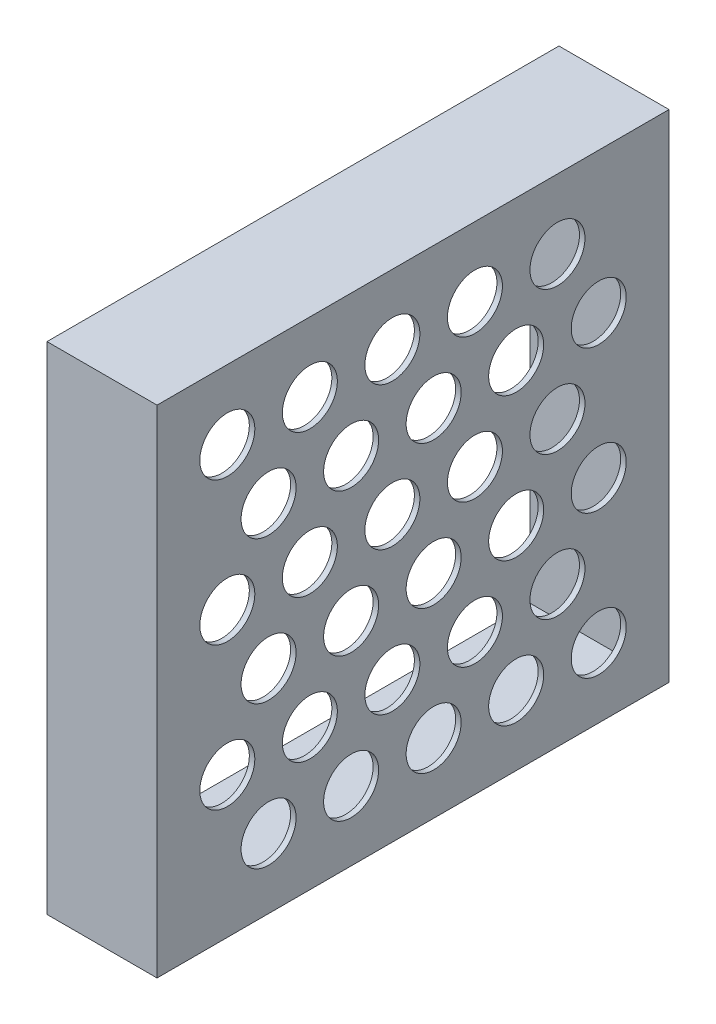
ISO-10303-21;
HEADER;
FILE_DESCRIPTION(('STEP AP214'),'2;1');
FILE_NAME('part.step','',(''),(''),'','','');
FILE_SCHEMA(('AUTOMOTIVE_DESIGN { 1 0 10303 214 1 1 1 1 }'));
ENDSEC;
DATA;
#1=APPLICATION_CONTEXT('core data for automotive mechanical design processes');
#2=APPLICATION_PROTOCOL_DEFINITION('international standard','automotive_design',2000,#1);
#3=PRODUCT_CONTEXT('',#1,'mechanical');
#4=PRODUCT('Part','Part','',(#3));
#5=PRODUCT_RELATED_PRODUCT_CATEGORY('part','',(#4));
#6=PRODUCT_DEFINITION_FORMATION('','',#4);
#7=PRODUCT_DEFINITION_CONTEXT('part definition',#1,'design');
#8=PRODUCT_DEFINITION('design','',#6,#7);
#9=PRODUCT_DEFINITION_SHAPE('','',#8);
#10=(LENGTH_UNIT() NAMED_UNIT(*) SI_UNIT(.MILLI.,.METRE.));
#11=(NAMED_UNIT(*) PLANE_ANGLE_UNIT() SI_UNIT($,.RADIAN.));
#12=(NAMED_UNIT(*) SI_UNIT($,.STERADIAN.) SOLID_ANGLE_UNIT());
#13=UNCERTAINTY_MEASURE_WITH_UNIT(LENGTH_MEASURE(1.E-05),#10,'distance_accuracy_value','');
#14=(GEOMETRIC_REPRESENTATION_CONTEXT(3) GLOBAL_UNCERTAINTY_ASSIGNED_CONTEXT((#13)) GLOBAL_UNIT_ASSIGNED_CONTEXT((#10,
#11,#12)) REPRESENTATION_CONTEXT('',''));
#15=CARTESIAN_POINT('',(0.,0.,0.));
#16=DIRECTION('',(0.,0.,1.));
#17=DIRECTION('',(1.,0.,0.));
#18=AXIS2_PLACEMENT_3D('',#15,#16,#17);
#19=CARTESIAN_POINT('',(3.75,-2.51392896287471,-65.625));
#20=DIRECTION('',(1.,0.,0.));
#21=DIRECTION('',(0.,0.,-1.));
#22=AXIS2_PLACEMENT_3D('',#19,#20,#21);
#23=PLANE('',#22);
#24=CARTESIAN_POINT('',(3.75,146.136071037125,-215.625));
#25=DIRECTION('',(1.,0.,0.));
#26=DIRECTION('',(0.,0.,-1.));
#27=AXIS2_PLACEMENT_3D('',#24,#25,#26);
#28=CIRCLE('',#27,12.5);
#29=CARTESIAN_POINT('',(3.75,146.136071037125,-228.125));
#30=VERTEX_POINT('',#29);
#31=EDGE_CURVE('E168',#30,#30,#28,.T.);
#32=ORIENTED_EDGE('',*,*,#31,.F.);
#33=EDGE_LOOP('',(#32));
#34=FACE_BOUND('',#33,.T.);
#35=CARTESIAN_POINT('',(3.75,146.136071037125,-140.625));
#36=DIRECTION('',(1.,0.,0.));
#37=DIRECTION('',(0.,0.,-1.));
#38=AXIS2_PLACEMENT_3D('',#35,#36,#37);
#39=CIRCLE('',#38,12.5);
#40=CARTESIAN_POINT('',(3.75,146.136071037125,-153.125));
#41=VERTEX_POINT('',#40);
#42=EDGE_CURVE('E180',#41,#41,#39,.T.);
#43=ORIENTED_EDGE('',*,*,#42,.F.);
#44=EDGE_LOOP('',(#43));
#45=FACE_BOUND('',#44,.T.);
#46=CARTESIAN_POINT('',(3.75,81.1860710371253,-253.125));
#47=DIRECTION('',(1.,0.,0.));
#48=DIRECTION('',(0.,0.,-1.));
#49=AXIS2_PLACEMENT_3D('',#46,#47,#48);
#50=CIRCLE('',#49,12.5);
#51=CARTESIAN_POINT('',(3.75,81.1860710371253,-265.625));
#52=VERTEX_POINT('',#51);
#53=EDGE_CURVE('E192',#52,#52,#50,.T.);
#54=ORIENTED_EDGE('',*,*,#53,.F.);
#55=EDGE_LOOP('',(#54));
#56=FACE_BOUND('',#55,.T.);
#57=CARTESIAN_POINT('',(3.75,81.1860710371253,-215.625));
#58=DIRECTION('',(1.,0.,0.));
#59=DIRECTION('',(0.,0.,-1.));
#60=AXIS2_PLACEMENT_3D('',#57,#58,#59);
#61=CIRCLE('',#60,12.5);
#62=CARTESIAN_POINT('',(3.75,81.1860710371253,-228.125));
#63=VERTEX_POINT('',#62);
#64=EDGE_CURVE('E204',#63,#63,#61,.T.);
#65=ORIENTED_EDGE('',*,*,#64,.F.);
#66=EDGE_LOOP('',(#65));
#67=FACE_BOUND('',#66,.T.);
#68=CARTESIAN_POINT('',(3.75,81.1860710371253,-178.125));
#69=DIRECTION('',(1.,0.,0.));
#70=DIRECTION('',(0.,0.,-1.));
#71=AXIS2_PLACEMENT_3D('',#68,#69,#70);
#72=CIRCLE('',#71,12.5);
#73=CARTESIAN_POINT('',(3.75,81.1860710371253,-190.625));
#74=VERTEX_POINT('',#73);
#75=EDGE_CURVE('E216',#74,#74,#72,.T.);
#76=ORIENTED_EDGE('',*,*,#75,.F.);
#77=EDGE_LOOP('',(#76));
#78=FACE_BOUND('',#77,.T.);
#79=CARTESIAN_POINT('',(3.75,81.1860710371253,-140.625));
#80=DIRECTION('',(1.,0.,0.));
#81=DIRECTION('',(0.,0.,-1.));
#82=AXIS2_PLACEMENT_3D('',#79,#80,#81);
#83=CIRCLE('',#82,12.5);
#84=CARTESIAN_POINT('',(3.75,81.1860710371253,-153.125));
#85=VERTEX_POINT('',#84);
#86=EDGE_CURVE('E228',#85,#85,#83,.T.);
#87=ORIENTED_EDGE('',*,*,#86,.F.);
#88=EDGE_LOOP('',(#87));
#89=FACE_BOUND('',#88,.T.);
#90=CARTESIAN_POINT('',(3.75,81.1860710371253,-103.125));
#91=DIRECTION('',(1.,0.,0.));
#92=DIRECTION('',(0.,0.,-1.));
#93=AXIS2_PLACEMENT_3D('',#90,#91,#92);
#94=CIRCLE('',#93,12.5);
#95=CARTESIAN_POINT('',(3.75,81.1860710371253,-115.625));
#96=VERTEX_POINT('',#95);
#97=EDGE_CURVE('E240',#96,#96,#94,.T.);
#98=ORIENTED_EDGE('',*,*,#97,.F.);
#99=EDGE_LOOP('',(#98));
#100=FACE_BOUND('',#99,.T.);
#101=CARTESIAN_POINT('',(3.75,16.2360710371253,-253.125));
#102=DIRECTION('',(1.,0.,0.));
#103=DIRECTION('',(0.,0.,-1.));
#104=AXIS2_PLACEMENT_3D('',#101,#102,#103);
#105=CIRCLE('',#104,12.5);
#106=CARTESIAN_POINT('',(3.75,16.2360710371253,-265.625));
#107=VERTEX_POINT('',#106);
#108=EDGE_CURVE('E252',#107,#107,#105,.T.);
#109=ORIENTED_EDGE('',*,*,#108,.F.);
#110=EDGE_LOOP('',(#109));
#111=FACE_BOUND('',#110,.T.);
#112=CARTESIAN_POINT('',(3.75,16.2360710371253,-215.625));
#113=DIRECTION('',(1.,0.,0.));
#114=DIRECTION('',(0.,0.,-1.));
#115=AXIS2_PLACEMENT_3D('',#112,#113,#114);
#116=CIRCLE('',#115,12.5);
#117=CARTESIAN_POINT('',(3.75,16.2360710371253,-228.125));
#118=VERTEX_POINT('',#117);
#119=EDGE_CURVE('E264',#118,#118,#116,.T.);
#120=ORIENTED_EDGE('',*,*,#119,.F.);
#121=EDGE_LOOP('',(#120));
#122=FACE_BOUND('',#121,.T.);
#123=CARTESIAN_POINT('',(3.75,16.2360710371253,-178.125));
#124=DIRECTION('',(1.,0.,0.));
#125=DIRECTION('',(0.,0.,-1.));
#126=AXIS2_PLACEMENT_3D('',#123,#124,#125);
#127=CIRCLE('',#126,12.5);
#128=CARTESIAN_POINT('',(3.75,16.2360710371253,-190.625));
#129=VERTEX_POINT('',#128);
#130=EDGE_CURVE('E276',#129,#129,#127,.T.);
#131=ORIENTED_EDGE('',*,*,#130,.F.);
#132=EDGE_LOOP('',(#131));
#133=FACE_BOUND('',#132,.T.);
#134=CARTESIAN_POINT('',(3.75,16.2360710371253,-140.625));
#135=DIRECTION('',(1.,0.,0.));
#136=DIRECTION('',(0.,0.,-1.));
#137=AXIS2_PLACEMENT_3D('',#134,#135,#136);
#138=CIRCLE('',#137,12.5);
#139=CARTESIAN_POINT('',(3.75,16.2360710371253,-153.125));
#140=VERTEX_POINT('',#139);
#141=EDGE_CURVE('E288',#140,#140,#138,.T.);
#142=ORIENTED_EDGE('',*,*,#141,.F.);
#143=EDGE_LOOP('',(#142));
#144=FACE_BOUND('',#143,.T.);
#145=CARTESIAN_POINT('',(3.75,113.662023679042,-84.3749999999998));
#146=DIRECTION('',(1.,0.,0.));
#147=DIRECTION('',(0.,0.,-1.));
#148=AXIS2_PLACEMENT_3D('',#145,#146,#147);
#149=CIRCLE('',#148,12.5);
#150=CARTESIAN_POINT('',(3.75,113.662023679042,-96.8749999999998));
#151=VERTEX_POINT('',#150);
#152=EDGE_CURVE('E300',#151,#151,#149,.T.);
#153=ORIENTED_EDGE('',*,*,#152,.F.);
#154=EDGE_LOOP('',(#153));
#155=FACE_BOUND('',#154,.T.);
#156=CARTESIAN_POINT('',(3.75,48.7120236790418,-234.375));
#157=DIRECTION('',(1.,0.,0.));
#158=DIRECTION('',(0.,0.,-1.));
#159=AXIS2_PLACEMENT_3D('',#156,#157,#158);
#160=CIRCLE('',#159,12.5);
#161=CARTESIAN_POINT('',(3.75,48.7120236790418,-246.875));
#162=VERTEX_POINT('',#161);
#163=EDGE_CURVE('E312',#162,#162,#160,.T.);
#164=ORIENTED_EDGE('',*,*,#163,.F.);
#165=EDGE_LOOP('',(#164));
#166=FACE_BOUND('',#165,.T.);
#167=CARTESIAN_POINT('',(3.75,48.7120236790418,-159.375));
#168=DIRECTION('',(1.,0.,0.));
#169=DIRECTION('',(0.,0.,-1.));
#170=AXIS2_PLACEMENT_3D('',#167,#168,#169);
#171=CIRCLE('',#170,12.5);
#172=CARTESIAN_POINT('',(3.75,48.7120236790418,-171.875));
#173=VERTEX_POINT('',#172);
#174=EDGE_CURVE('E324',#173,#173,#171,.T.);
#175=ORIENTED_EDGE('',*,*,#174,.F.);
#176=EDGE_LOOP('',(#175));
#177=FACE_BOUND('',#176,.T.);
#178=CARTESIAN_POINT('',(3.75,48.7120236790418,-84.375));
#179=DIRECTION('',(1.,0.,0.));
#180=DIRECTION('',(0.,0.,-1.));
#181=AXIS2_PLACEMENT_3D('',#178,#179,#180);
#182=CIRCLE('',#181,12.5);
#183=CARTESIAN_POINT('',(3.75,48.7120236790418,-96.875));
#184=VERTEX_POINT('',#183);
#185=EDGE_CURVE('E336',#184,#184,#182,.T.);
#186=ORIENTED_EDGE('',*,*,#185,.F.);
#187=EDGE_LOOP('',(#186));
#188=FACE_BOUND('',#187,.T.);
#189=CARTESIAN_POINT('',(3.75,48.7120236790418,-121.875));
#190=DIRECTION('',(1.,0.,0.));
#191=DIRECTION('',(0.,0.,-1.));
#192=AXIS2_PLACEMENT_3D('',#189,#190,#191);
#193=CIRCLE('',#192,12.5);
#194=CARTESIAN_POINT('',(3.75,48.7120236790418,-134.375));
#195=VERTEX_POINT('',#194);
#196=EDGE_CURVE('E330',#195,#195,#193,.T.);
#197=ORIENTED_EDGE('',*,*,#196,.F.);
#198=EDGE_LOOP('',(#197));
#199=FACE_BOUND('',#198,.T.);
#200=CARTESIAN_POINT('',(3.75,48.7120236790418,-196.875));
#201=DIRECTION('',(1.,0.,0.));
#202=DIRECTION('',(0.,0.,-1.));
#203=AXIS2_PLACEMENT_3D('',#200,#201,#202);
#204=CIRCLE('',#203,12.5);
#205=CARTESIAN_POINT('',(3.75,48.7120236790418,-209.375));
#206=VERTEX_POINT('',#205);
#207=EDGE_CURVE('E318',#206,#206,#204,.T.);
#208=ORIENTED_EDGE('',*,*,#207,.F.);
#209=EDGE_LOOP('',(#208));
#210=FACE_BOUND('',#209,.T.);
#211=CARTESIAN_POINT('',(3.75,16.2360710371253,-103.125));
#212=DIRECTION('',(1.,0.,0.));
#213=DIRECTION('',(0.,0.,-1.));
#214=AXIS2_PLACEMENT_3D('',#211,#212,#213);
#215=CIRCLE('',#214,12.5);
#216=CARTESIAN_POINT('',(3.75,16.2360710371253,-115.625));
#217=VERTEX_POINT('',#216);
#218=EDGE_CURVE('E306',#217,#217,#215,.T.);
#219=ORIENTED_EDGE('',*,*,#218,.F.);
#220=EDGE_LOOP('',(#219));
#221=FACE_BOUND('',#220,.T.);
#222=CARTESIAN_POINT('',(3.75,113.662023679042,-121.875));
#223=DIRECTION('',(1.,0.,0.));
#224=DIRECTION('',(0.,0.,-1.));
#225=AXIS2_PLACEMENT_3D('',#222,#223,#224);
#226=CIRCLE('',#225,12.5);
#227=CARTESIAN_POINT('',(3.75,113.662023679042,-134.375));
#228=VERTEX_POINT('',#227);
#229=EDGE_CURVE('E294',#228,#228,#226,.T.);
#230=ORIENTED_EDGE('',*,*,#229,.F.);
#231=EDGE_LOOP('',(#230));
#232=FACE_BOUND('',#231,.T.);
#233=CARTESIAN_POINT('',(3.75,113.662023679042,-159.375));
#234=DIRECTION('',(1.,0.,0.));
#235=DIRECTION('',(0.,0.,-1.));
#236=AXIS2_PLACEMENT_3D('',#233,#234,#235);
#237=CIRCLE('',#236,12.5);
#238=CARTESIAN_POINT('',(3.75,113.662023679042,-171.875));
#239=VERTEX_POINT('',#238);
#240=EDGE_CURVE('E282',#239,#239,#237,.T.);
#241=ORIENTED_EDGE('',*,*,#240,.F.);
#242=EDGE_LOOP('',(#241));
#243=FACE_BOUND('',#242,.T.);
#244=CARTESIAN_POINT('',(3.75,113.662023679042,-196.875));
#245=DIRECTION('',(1.,0.,0.));
#246=DIRECTION('',(0.,0.,-1.));
#247=AXIS2_PLACEMENT_3D('',#244,#245,#246);
#248=CIRCLE('',#247,12.5);
#249=CARTESIAN_POINT('',(3.75,113.662023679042,-209.375));
#250=VERTEX_POINT('',#249);
#251=EDGE_CURVE('E270',#250,#250,#248,.T.);
#252=ORIENTED_EDGE('',*,*,#251,.F.);
#253=EDGE_LOOP('',(#252));
#254=FACE_BOUND('',#253,.T.);
#255=CARTESIAN_POINT('',(3.75,113.662023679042,-234.375));
#256=DIRECTION('',(1.,0.,0.));
#257=DIRECTION('',(0.,0.,-1.));
#258=AXIS2_PLACEMENT_3D('',#255,#256,#257);
#259=CIRCLE('',#258,12.5);
#260=CARTESIAN_POINT('',(3.75,113.662023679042,-246.875));
#261=VERTEX_POINT('',#260);
#262=EDGE_CURVE('E258',#261,#261,#259,.T.);
#263=ORIENTED_EDGE('',*,*,#262,.F.);
#264=EDGE_LOOP('',(#263));
#265=FACE_BOUND('',#264,.T.);
#266=CARTESIAN_POINT('',(3.75,178.612023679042,-84.3749999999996));
#267=DIRECTION('',(1.,0.,0.));
#268=DIRECTION('',(0.,0.,-1.));
#269=AXIS2_PLACEMENT_3D('',#266,#267,#268);
#270=CIRCLE('',#269,12.5);
#271=CARTESIAN_POINT('',(3.75,178.612023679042,-96.8749999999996));
#272=VERTEX_POINT('',#271);
#273=EDGE_CURVE('E246',#272,#272,#270,.T.);
#274=ORIENTED_EDGE('',*,*,#273,.F.);
#275=EDGE_LOOP('',(#274));
#276=FACE_BOUND('',#275,.T.);
#277=CARTESIAN_POINT('',(3.75,178.612023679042,-121.875));
#278=DIRECTION('',(1.,0.,0.));
#279=DIRECTION('',(0.,0.,-1.));
#280=AXIS2_PLACEMENT_3D('',#277,#278,#279);
#281=CIRCLE('',#280,12.5);
#282=CARTESIAN_POINT('',(3.75,178.612023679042,-134.375));
#283=VERTEX_POINT('',#282);
#284=EDGE_CURVE('E234',#283,#283,#281,.T.);
#285=ORIENTED_EDGE('',*,*,#284,.F.);
#286=EDGE_LOOP('',(#285));
#287=FACE_BOUND('',#286,.T.);
#288=CARTESIAN_POINT('',(3.75,178.612023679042,-159.375));
#289=DIRECTION('',(1.,0.,0.));
#290=DIRECTION('',(0.,0.,-1.));
#291=AXIS2_PLACEMENT_3D('',#288,#289,#290);
#292=CIRCLE('',#291,12.5);
#293=CARTESIAN_POINT('',(3.75,178.612023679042,-171.875));
#294=VERTEX_POINT('',#293);
#295=EDGE_CURVE('E222',#294,#294,#292,.T.);
#296=ORIENTED_EDGE('',*,*,#295,.F.);
#297=EDGE_LOOP('',(#296));
#298=FACE_BOUND('',#297,.T.);
#299=CARTESIAN_POINT('',(3.75,178.612023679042,-196.875));
#300=DIRECTION('',(1.,0.,0.));
#301=DIRECTION('',(0.,0.,-1.));
#302=AXIS2_PLACEMENT_3D('',#299,#300,#301);
#303=CIRCLE('',#302,12.5);
#304=CARTESIAN_POINT('',(3.75,178.612023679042,-209.375));
#305=VERTEX_POINT('',#304);
#306=EDGE_CURVE('E210',#305,#305,#303,.T.);
#307=ORIENTED_EDGE('',*,*,#306,.F.);
#308=EDGE_LOOP('',(#307));
#309=FACE_BOUND('',#308,.T.);
#310=CARTESIAN_POINT('',(3.75,178.612023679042,-234.375));
#311=DIRECTION('',(1.,0.,0.));
#312=DIRECTION('',(0.,0.,-1.));
#313=AXIS2_PLACEMENT_3D('',#310,#311,#312);
#314=CIRCLE('',#313,12.5);
#315=CARTESIAN_POINT('',(3.75,178.612023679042,-246.875));
#316=VERTEX_POINT('',#315);
#317=EDGE_CURVE('E198',#316,#316,#314,.T.);
#318=ORIENTED_EDGE('',*,*,#317,.F.);
#319=EDGE_LOOP('',(#318));
#320=FACE_BOUND('',#319,.T.);
#321=CARTESIAN_POINT('',(3.75,146.136071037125,-103.125));
#322=DIRECTION('',(1.,0.,0.));
#323=DIRECTION('',(0.,0.,-1.));
#324=AXIS2_PLACEMENT_3D('',#321,#322,#323);
#325=CIRCLE('',#324,12.5);
#326=CARTESIAN_POINT('',(3.75,146.136071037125,-115.625));
#327=VERTEX_POINT('',#326);
#328=EDGE_CURVE('E186',#327,#327,#325,.T.);
#329=ORIENTED_EDGE('',*,*,#328,.F.);
#330=EDGE_LOOP('',(#329));
#331=FACE_BOUND('',#330,.T.);
#332=CARTESIAN_POINT('',(3.75,146.136071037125,-178.125));
#333=DIRECTION('',(1.,0.,0.));
#334=DIRECTION('',(0.,0.,-1.));
#335=AXIS2_PLACEMENT_3D('',#332,#333,#334);
#336=CIRCLE('',#335,12.5);
#337=CARTESIAN_POINT('',(3.75,146.136071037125,-190.625));
#338=VERTEX_POINT('',#337);
#339=EDGE_CURVE('E174',#338,#338,#336,.T.);
#340=ORIENTED_EDGE('',*,*,#339,.F.);
#341=EDGE_LOOP('',(#340));
#342=FACE_BOUND('',#341,.T.);
#343=CARTESIAN_POINT('',(3.75,146.136071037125,-253.125));
#344=DIRECTION('',(1.,0.,0.));
#345=DIRECTION('',(0.,0.,-1.));
#346=AXIS2_PLACEMENT_3D('',#343,#344,#345);
#347=CIRCLE('',#346,12.5);
#348=CARTESIAN_POINT('',(3.75,146.136071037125,-265.625));
#349=VERTEX_POINT('',#348);
#350=EDGE_CURVE('E162',#349,#349,#347,.T.);
#351=ORIENTED_EDGE('',*,*,#350,.F.);
#352=EDGE_LOOP('',(#351));
#353=FACE_BOUND('',#352,.T.);
#354=DIRECTION('',(0.,1.,0.));
#355=VECTOR('',#354,1.);
#356=CARTESIAN_POINT('',(3.75,97.4240473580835,-52.4414568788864));
#357=LINE('',#356,#355);
#358=CARTESIAN_POINT('',(3.75,-15.2900416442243,-52.4414568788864));
#359=VERTEX_POINT('',#358);
#360=CARTESIAN_POINT('',(3.75,210.138136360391,-52.4414568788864));
#361=VERTEX_POINT('',#360);
#362=EDGE_CURVE('E140',#359,#361,#357,.T.);
#363=ORIENTED_EDGE('',*,*,#362,.F.);
#364=DIRECTION('',(0.,0.,1.));
#365=VECTOR('',#364,1.);
#366=CARTESIAN_POINT('',(3.75,-15.2900416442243,-420.847342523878));
#367=LINE('',#366,#365);
#368=CARTESIAN_POINT('',(3.75,-15.2900416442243,-285.058543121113));
#369=VERTEX_POINT('',#368);
#370=EDGE_CURVE('E113',#369,#359,#367,.T.);
#371=ORIENTED_EDGE('',*,*,#370,.F.);
#372=DIRECTION('',(0.,1.,0.));
#373=VECTOR('',#372,1.);
#374=CARTESIAN_POINT('',(3.75,97.4240473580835,-285.058543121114));
#375=LINE('',#374,#373);
#376=CARTESIAN_POINT('',(3.75,210.138136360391,-285.058543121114));
#377=VERTEX_POINT('',#376);
#378=EDGE_CURVE('E126',#369,#377,#375,.T.);
#379=ORIENTED_EDGE('',*,*,#378,.T.);
#380=DIRECTION('',(0.,0.,1.));
#381=VECTOR('',#380,1.);
#382=CARTESIAN_POINT('',(3.75,210.138136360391,-420.847342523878));
#383=LINE('',#382,#381);
#384=EDGE_CURVE('E123',#377,#361,#383,.T.);
#385=ORIENTED_EDGE('',*,*,#384,.T.);
#386=EDGE_LOOP('',(#363,#371,#379,#385));
#387=FACE_BOUND('',#386,.T.);
#388=ADVANCED_FACE('F37',(#34,#45,#56,#67,#78,#89,#100,#111,#122,#133,#144,#155,#166,#177,#188,
#199,#210,#221,#232,#243,#254,#265,#276,#287,#298,#309,#320,#331,#342,#353,#387),#23,.T.);
#389=CARTESIAN_POINT('',(1.25,-2.51392896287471,-65.625));
#390=DIRECTION('',(1.,0.,0.));
#391=DIRECTION('',(0.,0.,-1.));
#392=AXIS2_PLACEMENT_3D('',#389,#390,#391);
#393=PLANE('',#392);
#394=CARTESIAN_POINT('',(1.25,146.136071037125,-215.625));
#395=DIRECTION('',(1.,0.,0.));
#396=DIRECTION('',(0.,0.,-1.));
#397=AXIS2_PLACEMENT_3D('',#394,#395,#396);
#398=CIRCLE('',#397,12.5);
#399=CARTESIAN_POINT('',(1.25,146.136071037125,-228.125));
#400=VERTEX_POINT('',#399);
#401=EDGE_CURVE('E165',#400,#400,#398,.T.);
#402=ORIENTED_EDGE('',*,*,#401,.T.);
#403=EDGE_LOOP('',(#402));
#404=FACE_BOUND('',#403,.T.);
#405=CARTESIAN_POINT('',(1.25,146.136071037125,-140.625));
#406=DIRECTION('',(1.,0.,0.));
#407=DIRECTION('',(0.,0.,-1.));
#408=AXIS2_PLACEMENT_3D('',#405,#406,#407);
#409=CIRCLE('',#408,12.5);
#410=CARTESIAN_POINT('',(1.25,146.136071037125,-153.125));
#411=VERTEX_POINT('',#410);
#412=EDGE_CURVE('E177',#411,#411,#409,.T.);
#413=ORIENTED_EDGE('',*,*,#412,.T.);
#414=EDGE_LOOP('',(#413));
#415=FACE_BOUND('',#414,.T.);
#416=CARTESIAN_POINT('',(1.25,81.1860710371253,-253.125));
#417=DIRECTION('',(1.,0.,0.));
#418=DIRECTION('',(0.,0.,-1.));
#419=AXIS2_PLACEMENT_3D('',#416,#417,#418);
#420=CIRCLE('',#419,12.5);
#421=CARTESIAN_POINT('',(1.25,81.1860710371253,-265.625));
#422=VERTEX_POINT('',#421);
#423=EDGE_CURVE('E189',#422,#422,#420,.T.);
#424=ORIENTED_EDGE('',*,*,#423,.T.);
#425=EDGE_LOOP('',(#424));
#426=FACE_BOUND('',#425,.T.);
#427=CARTESIAN_POINT('',(1.25,81.1860710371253,-215.625));
#428=DIRECTION('',(1.,0.,0.));
#429=DIRECTION('',(0.,0.,-1.));
#430=AXIS2_PLACEMENT_3D('',#427,#428,#429);
#431=CIRCLE('',#430,12.5);
#432=CARTESIAN_POINT('',(1.25,81.1860710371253,-228.125));
#433=VERTEX_POINT('',#432);
#434=EDGE_CURVE('E201',#433,#433,#431,.T.);
#435=ORIENTED_EDGE('',*,*,#434,.T.);
#436=EDGE_LOOP('',(#435));
#437=FACE_BOUND('',#436,.T.);
#438=CARTESIAN_POINT('',(1.25,81.1860710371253,-178.125));
#439=DIRECTION('',(1.,0.,0.));
#440=DIRECTION('',(0.,0.,-1.));
#441=AXIS2_PLACEMENT_3D('',#438,#439,#440);
#442=CIRCLE('',#441,12.5);
#443=CARTESIAN_POINT('',(1.25,81.1860710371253,-190.625));
#444=VERTEX_POINT('',#443);
#445=EDGE_CURVE('E213',#444,#444,#442,.T.);
#446=ORIENTED_EDGE('',*,*,#445,.T.);
#447=EDGE_LOOP('',(#446));
#448=FACE_BOUND('',#447,.T.);
#449=CARTESIAN_POINT('',(1.25,81.1860710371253,-140.625));
#450=DIRECTION('',(1.,0.,0.));
#451=DIRECTION('',(0.,0.,-1.));
#452=AXIS2_PLACEMENT_3D('',#449,#450,#451);
#453=CIRCLE('',#452,12.5);
#454=CARTESIAN_POINT('',(1.25,81.1860710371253,-153.125));
#455=VERTEX_POINT('',#454);
#456=EDGE_CURVE('E225',#455,#455,#453,.T.);
#457=ORIENTED_EDGE('',*,*,#456,.T.);
#458=EDGE_LOOP('',(#457));
#459=FACE_BOUND('',#458,.T.);
#460=CARTESIAN_POINT('',(1.25,81.1860710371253,-103.125));
#461=DIRECTION('',(1.,0.,0.));
#462=DIRECTION('',(0.,0.,-1.));
#463=AXIS2_PLACEMENT_3D('',#460,#461,#462);
#464=CIRCLE('',#463,12.5);
#465=CARTESIAN_POINT('',(1.25,81.1860710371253,-115.625));
#466=VERTEX_POINT('',#465);
#467=EDGE_CURVE('E237',#466,#466,#464,.T.);
#468=ORIENTED_EDGE('',*,*,#467,.T.);
#469=EDGE_LOOP('',(#468));
#470=FACE_BOUND('',#469,.T.);
#471=CARTESIAN_POINT('',(1.25,16.2360710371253,-253.125));
#472=DIRECTION('',(1.,0.,0.));
#473=DIRECTION('',(0.,0.,-1.));
#474=AXIS2_PLACEMENT_3D('',#471,#472,#473);
#475=CIRCLE('',#474,12.5);
#476=CARTESIAN_POINT('',(1.25,16.2360710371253,-265.625));
#477=VERTEX_POINT('',#476);
#478=EDGE_CURVE('E249',#477,#477,#475,.T.);
#479=ORIENTED_EDGE('',*,*,#478,.T.);
#480=EDGE_LOOP('',(#479));
#481=FACE_BOUND('',#480,.T.);
#482=CARTESIAN_POINT('',(1.25,16.2360710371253,-215.625));
#483=DIRECTION('',(1.,0.,0.));
#484=DIRECTION('',(0.,0.,-1.));
#485=AXIS2_PLACEMENT_3D('',#482,#483,#484);
#486=CIRCLE('',#485,12.5);
#487=CARTESIAN_POINT('',(1.25,16.2360710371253,-228.125));
#488=VERTEX_POINT('',#487);
#489=EDGE_CURVE('E261',#488,#488,#486,.T.);
#490=ORIENTED_EDGE('',*,*,#489,.T.);
#491=EDGE_LOOP('',(#490));
#492=FACE_BOUND('',#491,.T.);
#493=CARTESIAN_POINT('',(1.25,16.2360710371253,-178.125));
#494=DIRECTION('',(1.,0.,0.));
#495=DIRECTION('',(0.,0.,-1.));
#496=AXIS2_PLACEMENT_3D('',#493,#494,#495);
#497=CIRCLE('',#496,12.5);
#498=CARTESIAN_POINT('',(1.25,16.2360710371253,-190.625));
#499=VERTEX_POINT('',#498);
#500=EDGE_CURVE('E273',#499,#499,#497,.T.);
#501=ORIENTED_EDGE('',*,*,#500,.T.);
#502=EDGE_LOOP('',(#501));
#503=FACE_BOUND('',#502,.T.);
#504=CARTESIAN_POINT('',(1.25,16.2360710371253,-140.625));
#505=DIRECTION('',(1.,0.,0.));
#506=DIRECTION('',(0.,0.,-1.));
#507=AXIS2_PLACEMENT_3D('',#504,#505,#506);
#508=CIRCLE('',#507,12.5);
#509=CARTESIAN_POINT('',(1.25,16.2360710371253,-153.125));
#510=VERTEX_POINT('',#509);
#511=EDGE_CURVE('E285',#510,#510,#508,.T.);
#512=ORIENTED_EDGE('',*,*,#511,.T.);
#513=EDGE_LOOP('',(#512));
#514=FACE_BOUND('',#513,.T.);
#515=CARTESIAN_POINT('',(1.25,113.662023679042,-84.3749999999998));
#516=DIRECTION('',(1.,0.,0.));
#517=DIRECTION('',(0.,0.,-1.));
#518=AXIS2_PLACEMENT_3D('',#515,#516,#517);
#519=CIRCLE('',#518,12.5);
#520=CARTESIAN_POINT('',(1.25,113.662023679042,-96.8749999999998));
#521=VERTEX_POINT('',#520);
#522=EDGE_CURVE('E297',#521,#521,#519,.T.);
#523=ORIENTED_EDGE('',*,*,#522,.T.);
#524=EDGE_LOOP('',(#523));
#525=FACE_BOUND('',#524,.T.);
#526=CARTESIAN_POINT('',(1.25,48.7120236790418,-234.375));
#527=DIRECTION('',(1.,0.,0.));
#528=DIRECTION('',(0.,0.,-1.));
#529=AXIS2_PLACEMENT_3D('',#526,#527,#528);
#530=CIRCLE('',#529,12.5);
#531=CARTESIAN_POINT('',(1.25,48.7120236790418,-246.875));
#532=VERTEX_POINT('',#531);
#533=EDGE_CURVE('E309',#532,#532,#530,.T.);
#534=ORIENTED_EDGE('',*,*,#533,.T.);
#535=EDGE_LOOP('',(#534));
#536=FACE_BOUND('',#535,.T.);
#537=CARTESIAN_POINT('',(1.25,48.7120236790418,-159.375));
#538=DIRECTION('',(1.,0.,0.));
#539=DIRECTION('',(0.,0.,-1.));
#540=AXIS2_PLACEMENT_3D('',#537,#538,#539);
#541=CIRCLE('',#540,12.5);
#542=CARTESIAN_POINT('',(1.25,48.7120236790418,-171.875));
#543=VERTEX_POINT('',#542);
#544=EDGE_CURVE('E321',#543,#543,#541,.T.);
#545=ORIENTED_EDGE('',*,*,#544,.T.);
#546=EDGE_LOOP('',(#545));
#547=FACE_BOUND('',#546,.T.);
#548=CARTESIAN_POINT('',(1.25,48.7120236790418,-84.375));
#549=DIRECTION('',(1.,0.,0.));
#550=DIRECTION('',(0.,0.,-1.));
#551=AXIS2_PLACEMENT_3D('',#548,#549,#550);
#552=CIRCLE('',#551,12.5);
#553=CARTESIAN_POINT('',(1.25,48.7120236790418,-96.875));
#554=VERTEX_POINT('',#553);
#555=EDGE_CURVE('E333',#554,#554,#552,.T.);
#556=ORIENTED_EDGE('',*,*,#555,.T.);
#557=EDGE_LOOP('',(#556));
#558=FACE_BOUND('',#557,.T.);
#559=DIRECTION('',(0.,-1.,0.));
#560=VECTOR('',#559,1.);
#561=CARTESIAN_POINT('',(1.25,197.362023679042,-65.625));
#562=LINE('',#561,#560);
#563=CARTESIAN_POINT('',(1.25,197.362023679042,-65.625));
#564=VERTEX_POINT('',#563);
#565=CARTESIAN_POINT('',(1.25,-2.51392896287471,-65.625));
#566=VERTEX_POINT('',#565);
#567=EDGE_CURVE('E339',#564,#566,#562,.T.);
#568=ORIENTED_EDGE('',*,*,#567,.F.);
#569=DIRECTION('',(0.,0.,1.));
#570=VECTOR('',#569,1.);
#571=CARTESIAN_POINT('',(1.25,197.362023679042,-65.625));
#572=LINE('',#571,#570);
#573=CARTESIAN_POINT('',(1.25,197.362023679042,-271.875));
#574=VERTEX_POINT('',#573);
#575=EDGE_CURVE('E11',#574,#564,#572,.T.);
#576=ORIENTED_EDGE('',*,*,#575,.F.);
#577=DIRECTION('',(0.,1.,0.));
#578=VECTOR('',#577,1.);
#579=CARTESIAN_POINT('',(1.25,197.362023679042,-271.875));
#580=LINE('',#579,#578);
#581=CARTESIAN_POINT('',(1.25,-2.51392896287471,-271.875));
#582=VERTEX_POINT('',#581);
#583=EDGE_CURVE('E45',#582,#574,#580,.T.);
#584=ORIENTED_EDGE('',*,*,#583,.F.);
#585=DIRECTION('',(0.,0.,-1.));
#586=VECTOR('',#585,1.);
#587=CARTESIAN_POINT('',(1.25,-2.51392896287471,-65.625));
#588=LINE('',#587,#586);
#589=EDGE_CURVE('E344',#566,#582,#588,.T.);
#590=ORIENTED_EDGE('',*,*,#589,.F.);
#591=EDGE_LOOP('',(#568,#576,#584,#590));
#592=FACE_BOUND('',#591,.T.);
#593=CARTESIAN_POINT('',(1.25,48.7120236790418,-121.875));
#594=DIRECTION('',(1.,0.,0.));
#595=DIRECTION('',(0.,0.,-1.));
#596=AXIS2_PLACEMENT_3D('',#593,#594,#595);
#597=CIRCLE('',#596,12.5);
#598=CARTESIAN_POINT('',(1.25,48.7120236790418,-134.375));
#599=VERTEX_POINT('',#598);
#600=EDGE_CURVE('E327',#599,#599,#597,.T.);
#601=ORIENTED_EDGE('',*,*,#600,.T.);
#602=EDGE_LOOP('',(#601));
#603=FACE_BOUND('',#602,.T.);
#604=CARTESIAN_POINT('',(1.25,48.7120236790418,-196.875));
#605=DIRECTION('',(1.,0.,0.));
#606=DIRECTION('',(0.,0.,-1.));
#607=AXIS2_PLACEMENT_3D('',#604,#605,#606);
#608=CIRCLE('',#607,12.5);
#609=CARTESIAN_POINT('',(1.25,48.7120236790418,-209.375));
#610=VERTEX_POINT('',#609);
#611=EDGE_CURVE('E315',#610,#610,#608,.T.);
#612=ORIENTED_EDGE('',*,*,#611,.T.);
#613=EDGE_LOOP('',(#612));
#614=FACE_BOUND('',#613,.T.);
#615=CARTESIAN_POINT('',(1.25,16.2360710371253,-103.125));
#616=DIRECTION('',(1.,0.,0.));
#617=DIRECTION('',(0.,0.,-1.));
#618=AXIS2_PLACEMENT_3D('',#615,#616,#617);
#619=CIRCLE('',#618,12.5);
#620=CARTESIAN_POINT('',(1.25,16.2360710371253,-115.625));
#621=VERTEX_POINT('',#620);
#622=EDGE_CURVE('E303',#621,#621,#619,.T.);
#623=ORIENTED_EDGE('',*,*,#622,.T.);
#624=EDGE_LOOP('',(#623));
#625=FACE_BOUND('',#624,.T.);
#626=CARTESIAN_POINT('',(1.25,113.662023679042,-121.875));
#627=DIRECTION('',(1.,0.,0.));
#628=DIRECTION('',(0.,0.,-1.));
#629=AXIS2_PLACEMENT_3D('',#626,#627,#628);
#630=CIRCLE('',#629,12.5);
#631=CARTESIAN_POINT('',(1.25,113.662023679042,-134.375));
#632=VERTEX_POINT('',#631);
#633=EDGE_CURVE('E291',#632,#632,#630,.T.);
#634=ORIENTED_EDGE('',*,*,#633,.T.);
#635=EDGE_LOOP('',(#634));
#636=FACE_BOUND('',#635,.T.);
#637=CARTESIAN_POINT('',(1.25,113.662023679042,-159.375));
#638=DIRECTION('',(1.,0.,0.));
#639=DIRECTION('',(0.,0.,-1.));
#640=AXIS2_PLACEMENT_3D('',#637,#638,#639);
#641=CIRCLE('',#640,12.5);
#642=CARTESIAN_POINT('',(1.25,113.662023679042,-171.875));
#643=VERTEX_POINT('',#642);
#644=EDGE_CURVE('E279',#643,#643,#641,.T.);
#645=ORIENTED_EDGE('',*,*,#644,.T.);
#646=EDGE_LOOP('',(#645));
#647=FACE_BOUND('',#646,.T.);
#648=CARTESIAN_POINT('',(1.25,113.662023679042,-196.875));
#649=DIRECTION('',(1.,0.,0.));
#650=DIRECTION('',(0.,0.,-1.));
#651=AXIS2_PLACEMENT_3D('',#648,#649,#650);
#652=CIRCLE('',#651,12.5);
#653=CARTESIAN_POINT('',(1.25,113.662023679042,-209.375));
#654=VERTEX_POINT('',#653);
#655=EDGE_CURVE('E267',#654,#654,#652,.T.);
#656=ORIENTED_EDGE('',*,*,#655,.T.);
#657=EDGE_LOOP('',(#656));
#658=FACE_BOUND('',#657,.T.);
#659=CARTESIAN_POINT('',(1.25,113.662023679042,-234.375));
#660=DIRECTION('',(1.,0.,0.));
#661=DIRECTION('',(0.,0.,-1.));
#662=AXIS2_PLACEMENT_3D('',#659,#660,#661);
#663=CIRCLE('',#662,12.5);
#664=CARTESIAN_POINT('',(1.25,113.662023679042,-246.875));
#665=VERTEX_POINT('',#664);
#666=EDGE_CURVE('E255',#665,#665,#663,.T.);
#667=ORIENTED_EDGE('',*,*,#666,.T.);
#668=EDGE_LOOP('',(#667));
#669=FACE_BOUND('',#668,.T.);
#670=CARTESIAN_POINT('',(1.25,178.612023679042,-84.3749999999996));
#671=DIRECTION('',(1.,0.,0.));
#672=DIRECTION('',(0.,0.,-1.));
#673=AXIS2_PLACEMENT_3D('',#670,#671,#672);
#674=CIRCLE('',#673,12.5);
#675=CARTESIAN_POINT('',(1.25,178.612023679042,-96.8749999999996));
#676=VERTEX_POINT('',#675);
#677=EDGE_CURVE('E243',#676,#676,#674,.T.);
#678=ORIENTED_EDGE('',*,*,#677,.T.);
#679=EDGE_LOOP('',(#678));
#680=FACE_BOUND('',#679,.T.);
#681=CARTESIAN_POINT('',(1.25,178.612023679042,-121.875));
#682=DIRECTION('',(1.,0.,0.));
#683=DIRECTION('',(0.,0.,-1.));
#684=AXIS2_PLACEMENT_3D('',#681,#682,#683);
#685=CIRCLE('',#684,12.5);
#686=CARTESIAN_POINT('',(1.25,178.612023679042,-134.375));
#687=VERTEX_POINT('',#686);
#688=EDGE_CURVE('E231',#687,#687,#685,.T.);
#689=ORIENTED_EDGE('',*,*,#688,.T.);
#690=EDGE_LOOP('',(#689));
#691=FACE_BOUND('',#690,.T.);
#692=CARTESIAN_POINT('',(1.25,178.612023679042,-159.375));
#693=DIRECTION('',(1.,0.,0.));
#694=DIRECTION('',(0.,0.,-1.));
#695=AXIS2_PLACEMENT_3D('',#692,#693,#694);
#696=CIRCLE('',#695,12.5);
#697=CARTESIAN_POINT('',(1.25,178.612023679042,-171.875));
#698=VERTEX_POINT('',#697);
#699=EDGE_CURVE('E219',#698,#698,#696,.T.);
#700=ORIENTED_EDGE('',*,*,#699,.T.);
#701=EDGE_LOOP('',(#700));
#702=FACE_BOUND('',#701,.T.);
#703=CARTESIAN_POINT('',(1.25,178.612023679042,-196.875));
#704=DIRECTION('',(1.,0.,0.));
#705=DIRECTION('',(0.,0.,-1.));
#706=AXIS2_PLACEMENT_3D('',#703,#704,#705);
#707=CIRCLE('',#706,12.5);
#708=CARTESIAN_POINT('',(1.25,178.612023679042,-209.375));
#709=VERTEX_POINT('',#708);
#710=EDGE_CURVE('E207',#709,#709,#707,.T.);
#711=ORIENTED_EDGE('',*,*,#710,.T.);
#712=EDGE_LOOP('',(#711));
#713=FACE_BOUND('',#712,.T.);
#714=CARTESIAN_POINT('',(1.25,178.612023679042,-234.375));
#715=DIRECTION('',(1.,0.,0.));
#716=DIRECTION('',(0.,0.,-1.));
#717=AXIS2_PLACEMENT_3D('',#714,#715,#716);
#718=CIRCLE('',#717,12.5);
#719=CARTESIAN_POINT('',(1.25,178.612023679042,-246.875));
#720=VERTEX_POINT('',#719);
#721=EDGE_CURVE('E195',#720,#720,#718,.T.);
#722=ORIENTED_EDGE('',*,*,#721,.T.);
#723=EDGE_LOOP('',(#722));
#724=FACE_BOUND('',#723,.T.);
#725=CARTESIAN_POINT('',(1.25,146.136071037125,-103.125));
#726=DIRECTION('',(1.,0.,0.));
#727=DIRECTION('',(0.,0.,-1.));
#728=AXIS2_PLACEMENT_3D('',#725,#726,#727);
#729=CIRCLE('',#728,12.5);
#730=CARTESIAN_POINT('',(1.25,146.136071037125,-115.625));
#731=VERTEX_POINT('',#730);
#732=EDGE_CURVE('E183',#731,#731,#729,.T.);
#733=ORIENTED_EDGE('',*,*,#732,.T.);
#734=EDGE_LOOP('',(#733));
#735=FACE_BOUND('',#734,.T.);
#736=CARTESIAN_POINT('',(1.25,146.136071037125,-178.125));
#737=DIRECTION('',(1.,0.,0.));
#738=DIRECTION('',(0.,0.,-1.));
#739=AXIS2_PLACEMENT_3D('',#736,#737,#738);
#740=CIRCLE('',#739,12.5);
#741=CARTESIAN_POINT('',(1.25,146.136071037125,-190.625));
#742=VERTEX_POINT('',#741);
#743=EDGE_CURVE('E171',#742,#742,#740,.T.);
#744=ORIENTED_EDGE('',*,*,#743,.T.);
#745=EDGE_LOOP('',(#744));
#746=FACE_BOUND('',#745,.T.);
#747=CARTESIAN_POINT('',(1.25,146.136071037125,-253.125));
#748=DIRECTION('',(1.,0.,0.));
#749=DIRECTION('',(0.,0.,-1.));
#750=AXIS2_PLACEMENT_3D('',#747,#748,#749);
#751=CIRCLE('',#750,12.5);
#752=CARTESIAN_POINT('',(1.25,146.136071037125,-265.625));
#753=VERTEX_POINT('',#752);
#754=EDGE_CURVE('E148',#753,#753,#751,.T.);
#755=ORIENTED_EDGE('',*,*,#754,.T.);
#756=EDGE_LOOP('',(#755));
#757=FACE_BOUND('',#756,.T.);
#758=ADVANCED_FACE('F39',(#404,#415,#426,#437,#448,#459,#470,#481,#492,#503,#514,#525,#536,#547,
#558,#592,#603,#614,#625,#636,#647,#658,#669,#680,#691,#702,#713,#724,#735,#746,#757),#393,.F.);
#759=CARTESIAN_POINT('',(3.75,48.7120236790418,-84.375));
#760=DIRECTION('',(-1.,0.,0.));
#761=DIRECTION('',(0.,0.,1.));
#762=AXIS2_PLACEMENT_3D('',#759,#760,#761);
#763=CYLINDRICAL_SURFACE('',#762,12.5);
#764=ORIENTED_EDGE('',*,*,#185,.T.);
#765=EDGE_LOOP('',(#764));
#766=FACE_BOUND('',#765,.T.);
#767=ORIENTED_EDGE('',*,*,#555,.F.);
#768=EDGE_LOOP('',(#767));
#769=FACE_BOUND('',#768,.T.);
#770=ADVANCED_FACE('F375',(#766,#769),#763,.F.);
#771=CARTESIAN_POINT('',(3.75,48.7120236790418,-121.875));
#772=DIRECTION('',(-1.,0.,0.));
#773=DIRECTION('',(0.,0.,1.));
#774=AXIS2_PLACEMENT_3D('',#771,#772,#773);
#775=CYLINDRICAL_SURFACE('',#774,12.5);
#776=ORIENTED_EDGE('',*,*,#196,.T.);
#777=EDGE_LOOP('',(#776));
#778=FACE_BOUND('',#777,.T.);
#779=ORIENTED_EDGE('',*,*,#600,.F.);
#780=EDGE_LOOP('',(#779));
#781=FACE_BOUND('',#780,.T.);
#782=ADVANCED_FACE('F382',(#778,#781),#775,.F.);
#783=CARTESIAN_POINT('',(3.75,48.7120236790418,-159.375));
#784=DIRECTION('',(-1.,0.,0.));
#785=DIRECTION('',(0.,0.,1.));
#786=AXIS2_PLACEMENT_3D('',#783,#784,#785);
#787=CYLINDRICAL_SURFACE('',#786,12.5);
#788=ORIENTED_EDGE('',*,*,#174,.T.);
#789=EDGE_LOOP('',(#788));
#790=FACE_BOUND('',#789,.T.);
#791=ORIENTED_EDGE('',*,*,#544,.F.);
#792=EDGE_LOOP('',(#791));
#793=FACE_BOUND('',#792,.T.);
#794=ADVANCED_FACE('F386',(#790,#793),#787,.F.);
#795=CARTESIAN_POINT('',(3.75,48.7120236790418,-196.875));
#796=DIRECTION('',(-1.,0.,0.));
#797=DIRECTION('',(0.,0.,1.));
#798=AXIS2_PLACEMENT_3D('',#795,#796,#797);
#799=CYLINDRICAL_SURFACE('',#798,12.5);
#800=ORIENTED_EDGE('',*,*,#207,.T.);
#801=EDGE_LOOP('',(#800));
#802=FACE_BOUND('',#801,.T.);
#803=ORIENTED_EDGE('',*,*,#611,.F.);
#804=EDGE_LOOP('',(#803));
#805=FACE_BOUND('',#804,.T.);
#806=ADVANCED_FACE('F390',(#802,#805),#799,.F.);
#807=CARTESIAN_POINT('',(3.75,48.7120236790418,-234.375));
#808=DIRECTION('',(-1.,0.,0.));
#809=DIRECTION('',(0.,0.,1.));
#810=AXIS2_PLACEMENT_3D('',#807,#808,#809);
#811=CYLINDRICAL_SURFACE('',#810,12.5);
#812=ORIENTED_EDGE('',*,*,#163,.T.);
#813=EDGE_LOOP('',(#812));
#814=FACE_BOUND('',#813,.T.);
#815=ORIENTED_EDGE('',*,*,#533,.F.);
#816=EDGE_LOOP('',(#815));
#817=FACE_BOUND('',#816,.T.);
#818=ADVANCED_FACE('F394',(#814,#817),#811,.F.);
#819=CARTESIAN_POINT('',(3.75,16.2360710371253,-103.125));
#820=DIRECTION('',(-1.,0.,0.));
#821=DIRECTION('',(0.,0.,1.));
#822=AXIS2_PLACEMENT_3D('',#819,#820,#821);
#823=CYLINDRICAL_SURFACE('',#822,12.5);
#824=ORIENTED_EDGE('',*,*,#218,.T.);
#825=EDGE_LOOP('',(#824));
#826=FACE_BOUND('',#825,.T.);
#827=ORIENTED_EDGE('',*,*,#622,.F.);
#828=EDGE_LOOP('',(#827));
#829=FACE_BOUND('',#828,.T.);
#830=ADVANCED_FACE('F398',(#826,#829),#823,.F.);
#831=CARTESIAN_POINT('',(3.75,113.662023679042,-84.3749999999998));
#832=DIRECTION('',(-1.,0.,0.));
#833=DIRECTION('',(0.,0.,1.));
#834=AXIS2_PLACEMENT_3D('',#831,#832,#833);
#835=CYLINDRICAL_SURFACE('',#834,12.5);
#836=ORIENTED_EDGE('',*,*,#152,.T.);
#837=EDGE_LOOP('',(#836));
#838=FACE_BOUND('',#837,.T.);
#839=ORIENTED_EDGE('',*,*,#522,.F.);
#840=EDGE_LOOP('',(#839));
#841=FACE_BOUND('',#840,.T.);
#842=ADVANCED_FACE('F402',(#838,#841),#835,.F.);
#843=CARTESIAN_POINT('',(3.75,113.662023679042,-121.875));
#844=DIRECTION('',(-1.,0.,0.));
#845=DIRECTION('',(0.,0.,1.));
#846=AXIS2_PLACEMENT_3D('',#843,#844,#845);
#847=CYLINDRICAL_SURFACE('',#846,12.5);
#848=ORIENTED_EDGE('',*,*,#229,.T.);
#849=EDGE_LOOP('',(#848));
#850=FACE_BOUND('',#849,.T.);
#851=ORIENTED_EDGE('',*,*,#633,.F.);
#852=EDGE_LOOP('',(#851));
#853=FACE_BOUND('',#852,.T.);
#854=ADVANCED_FACE('F406',(#850,#853),#847,.F.);
#855=CARTESIAN_POINT('',(3.75,16.2360710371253,-140.625));
#856=DIRECTION('',(-1.,0.,0.));
#857=DIRECTION('',(0.,0.,1.));
#858=AXIS2_PLACEMENT_3D('',#855,#856,#857);
#859=CYLINDRICAL_SURFACE('',#858,12.5);
#860=ORIENTED_EDGE('',*,*,#141,.T.);
#861=EDGE_LOOP('',(#860));
#862=FACE_BOUND('',#861,.T.);
#863=ORIENTED_EDGE('',*,*,#511,.F.);
#864=EDGE_LOOP('',(#863));
#865=FACE_BOUND('',#864,.T.);
#866=ADVANCED_FACE('F410',(#862,#865),#859,.F.);
#867=CARTESIAN_POINT('',(3.75,113.662023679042,-159.375));
#868=DIRECTION('',(-1.,0.,0.));
#869=DIRECTION('',(0.,0.,1.));
#870=AXIS2_PLACEMENT_3D('',#867,#868,#869);
#871=CYLINDRICAL_SURFACE('',#870,12.5);
#872=ORIENTED_EDGE('',*,*,#240,.T.);
#873=EDGE_LOOP('',(#872));
#874=FACE_BOUND('',#873,.T.);
#875=ORIENTED_EDGE('',*,*,#644,.F.);
#876=EDGE_LOOP('',(#875));
#877=FACE_BOUND('',#876,.T.);
#878=ADVANCED_FACE('F414',(#874,#877),#871,.F.);
#879=CARTESIAN_POINT('',(3.75,16.2360710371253,-178.125));
#880=DIRECTION('',(-1.,0.,0.));
#881=DIRECTION('',(0.,0.,1.));
#882=AXIS2_PLACEMENT_3D('',#879,#880,#881);
#883=CYLINDRICAL_SURFACE('',#882,12.5);
#884=ORIENTED_EDGE('',*,*,#130,.T.);
#885=EDGE_LOOP('',(#884));
#886=FACE_BOUND('',#885,.T.);
#887=ORIENTED_EDGE('',*,*,#500,.F.);
#888=EDGE_LOOP('',(#887));
#889=FACE_BOUND('',#888,.T.);
#890=ADVANCED_FACE('F418',(#886,#889),#883,.F.);
#891=CARTESIAN_POINT('',(3.75,113.662023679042,-196.875));
#892=DIRECTION('',(-1.,0.,0.));
#893=DIRECTION('',(0.,0.,1.));
#894=AXIS2_PLACEMENT_3D('',#891,#892,#893);
#895=CYLINDRICAL_SURFACE('',#894,12.5);
#896=ORIENTED_EDGE('',*,*,#251,.T.);
#897=EDGE_LOOP('',(#896));
#898=FACE_BOUND('',#897,.T.);
#899=ORIENTED_EDGE('',*,*,#655,.F.);
#900=EDGE_LOOP('',(#899));
#901=FACE_BOUND('',#900,.T.);
#902=ADVANCED_FACE('F422',(#898,#901),#895,.F.);
#903=CARTESIAN_POINT('',(3.75,16.2360710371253,-215.625));
#904=DIRECTION('',(-1.,0.,0.));
#905=DIRECTION('',(0.,0.,1.));
#906=AXIS2_PLACEMENT_3D('',#903,#904,#905);
#907=CYLINDRICAL_SURFACE('',#906,12.5);
#908=ORIENTED_EDGE('',*,*,#119,.T.);
#909=EDGE_LOOP('',(#908));
#910=FACE_BOUND('',#909,.T.);
#911=ORIENTED_EDGE('',*,*,#489,.F.);
#912=EDGE_LOOP('',(#911));
#913=FACE_BOUND('',#912,.T.);
#914=ADVANCED_FACE('F426',(#910,#913),#907,.F.);
#915=CARTESIAN_POINT('',(3.75,113.662023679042,-234.375));
#916=DIRECTION('',(-1.,0.,0.));
#917=DIRECTION('',(0.,0.,1.));
#918=AXIS2_PLACEMENT_3D('',#915,#916,#917);
#919=CYLINDRICAL_SURFACE('',#918,12.5);
#920=ORIENTED_EDGE('',*,*,#262,.T.);
#921=EDGE_LOOP('',(#920));
#922=FACE_BOUND('',#921,.T.);
#923=ORIENTED_EDGE('',*,*,#666,.F.);
#924=EDGE_LOOP('',(#923));
#925=FACE_BOUND('',#924,.T.);
#926=ADVANCED_FACE('F430',(#922,#925),#919,.F.);
#927=CARTESIAN_POINT('',(3.75,16.2360710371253,-253.125));
#928=DIRECTION('',(-1.,0.,0.));
#929=DIRECTION('',(0.,0.,1.));
#930=AXIS2_PLACEMENT_3D('',#927,#928,#929);
#931=CYLINDRICAL_SURFACE('',#930,12.5);
#932=ORIENTED_EDGE('',*,*,#108,.T.);
#933=EDGE_LOOP('',(#932));
#934=FACE_BOUND('',#933,.T.);
#935=ORIENTED_EDGE('',*,*,#478,.F.);
#936=EDGE_LOOP('',(#935));
#937=FACE_BOUND('',#936,.T.);
#938=ADVANCED_FACE('F434',(#934,#937),#931,.F.);
#939=CARTESIAN_POINT('',(3.75,178.612023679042,-84.3749999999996));
#940=DIRECTION('',(-1.,0.,0.));
#941=DIRECTION('',(0.,0.,1.));
#942=AXIS2_PLACEMENT_3D('',#939,#940,#941);
#943=CYLINDRICAL_SURFACE('',#942,12.5);
#944=ORIENTED_EDGE('',*,*,#273,.T.);
#945=EDGE_LOOP('',(#944));
#946=FACE_BOUND('',#945,.T.);
#947=ORIENTED_EDGE('',*,*,#677,.F.);
#948=EDGE_LOOP('',(#947));
#949=FACE_BOUND('',#948,.T.);
#950=ADVANCED_FACE('F438',(#946,#949),#943,.F.);
#951=CARTESIAN_POINT('',(3.75,81.1860710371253,-103.125));
#952=DIRECTION('',(-1.,0.,0.));
#953=DIRECTION('',(0.,0.,1.));
#954=AXIS2_PLACEMENT_3D('',#951,#952,#953);
#955=CYLINDRICAL_SURFACE('',#954,12.5);
#956=ORIENTED_EDGE('',*,*,#97,.T.);
#957=EDGE_LOOP('',(#956));
#958=FACE_BOUND('',#957,.T.);
#959=ORIENTED_EDGE('',*,*,#467,.F.);
#960=EDGE_LOOP('',(#959));
#961=FACE_BOUND('',#960,.T.);
#962=ADVANCED_FACE('F442',(#958,#961),#955,.F.);
#963=CARTESIAN_POINT('',(3.75,178.612023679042,-121.875));
#964=DIRECTION('',(-1.,0.,0.));
#965=DIRECTION('',(0.,0.,1.));
#966=AXIS2_PLACEMENT_3D('',#963,#964,#965);
#967=CYLINDRICAL_SURFACE('',#966,12.5);
#968=ORIENTED_EDGE('',*,*,#284,.T.);
#969=EDGE_LOOP('',(#968));
#970=FACE_BOUND('',#969,.T.);
#971=ORIENTED_EDGE('',*,*,#688,.F.);
#972=EDGE_LOOP('',(#971));
#973=FACE_BOUND('',#972,.T.);
#974=ADVANCED_FACE('F446',(#970,#973),#967,.F.);
#975=CARTESIAN_POINT('',(3.75,81.1860710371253,-140.625));
#976=DIRECTION('',(-1.,0.,0.));
#977=DIRECTION('',(0.,0.,1.));
#978=AXIS2_PLACEMENT_3D('',#975,#976,#977);
#979=CYLINDRICAL_SURFACE('',#978,12.5);
#980=ORIENTED_EDGE('',*,*,#86,.T.);
#981=EDGE_LOOP('',(#980));
#982=FACE_BOUND('',#981,.T.);
#983=ORIENTED_EDGE('',*,*,#456,.F.);
#984=EDGE_LOOP('',(#983));
#985=FACE_BOUND('',#984,.T.);
#986=ADVANCED_FACE('F450',(#982,#985),#979,.F.);
#987=CARTESIAN_POINT('',(3.75,178.612023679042,-159.375));
#988=DIRECTION('',(-1.,0.,0.));
#989=DIRECTION('',(0.,0.,1.));
#990=AXIS2_PLACEMENT_3D('',#987,#988,#989);
#991=CYLINDRICAL_SURFACE('',#990,12.5);
#992=ORIENTED_EDGE('',*,*,#295,.T.);
#993=EDGE_LOOP('',(#992));
#994=FACE_BOUND('',#993,.T.);
#995=ORIENTED_EDGE('',*,*,#699,.F.);
#996=EDGE_LOOP('',(#995));
#997=FACE_BOUND('',#996,.T.);
#998=ADVANCED_FACE('F454',(#994,#997),#991,.F.);
#999=CARTESIAN_POINT('',(3.75,81.1860710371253,-178.125));
#1000=DIRECTION('',(-1.,0.,0.));
#1001=DIRECTION('',(0.,0.,1.));
#1002=AXIS2_PLACEMENT_3D('',#999,#1000,#1001);
#1003=CYLINDRICAL_SURFACE('',#1002,12.5);
#1004=ORIENTED_EDGE('',*,*,#75,.T.);
#1005=EDGE_LOOP('',(#1004));
#1006=FACE_BOUND('',#1005,.T.);
#1007=ORIENTED_EDGE('',*,*,#445,.F.);
#1008=EDGE_LOOP('',(#1007));
#1009=FACE_BOUND('',#1008,.T.);
#1010=ADVANCED_FACE('F458',(#1006,#1009),#1003,.F.);
#1011=CARTESIAN_POINT('',(3.75,178.612023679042,-196.875));
#1012=DIRECTION('',(-1.,0.,0.));
#1013=DIRECTION('',(0.,0.,1.));
#1014=AXIS2_PLACEMENT_3D('',#1011,#1012,#1013);
#1015=CYLINDRICAL_SURFACE('',#1014,12.5);
#1016=ORIENTED_EDGE('',*,*,#306,.T.);
#1017=EDGE_LOOP('',(#1016));
#1018=FACE_BOUND('',#1017,.T.);
#1019=ORIENTED_EDGE('',*,*,#710,.F.);
#1020=EDGE_LOOP('',(#1019));
#1021=FACE_BOUND('',#1020,.T.);
#1022=ADVANCED_FACE('F462',(#1018,#1021),#1015,.F.);
#1023=CARTESIAN_POINT('',(3.75,81.1860710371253,-215.625));
#1024=DIRECTION('',(-1.,0.,0.));
#1025=DIRECTION('',(0.,0.,1.));
#1026=AXIS2_PLACEMENT_3D('',#1023,#1024,#1025);
#1027=CYLINDRICAL_SURFACE('',#1026,12.5);
#1028=ORIENTED_EDGE('',*,*,#64,.T.);
#1029=EDGE_LOOP('',(#1028));
#1030=FACE_BOUND('',#1029,.T.);
#1031=ORIENTED_EDGE('',*,*,#434,.F.);
#1032=EDGE_LOOP('',(#1031));
#1033=FACE_BOUND('',#1032,.T.);
#1034=ADVANCED_FACE('F466',(#1030,#1033),#1027,.F.);
#1035=CARTESIAN_POINT('',(3.75,178.612023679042,-234.375));
#1036=DIRECTION('',(-1.,0.,0.));
#1037=DIRECTION('',(0.,0.,1.));
#1038=AXIS2_PLACEMENT_3D('',#1035,#1036,#1037);
#1039=CYLINDRICAL_SURFACE('',#1038,12.5);
#1040=ORIENTED_EDGE('',*,*,#317,.T.);
#1041=EDGE_LOOP('',(#1040));
#1042=FACE_BOUND('',#1041,.T.);
#1043=ORIENTED_EDGE('',*,*,#721,.F.);
#1044=EDGE_LOOP('',(#1043));
#1045=FACE_BOUND('',#1044,.T.);
#1046=ADVANCED_FACE('F470',(#1042,#1045),#1039,.F.);
#1047=CARTESIAN_POINT('',(3.75,81.1860710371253,-253.125));
#1048=DIRECTION('',(-1.,0.,0.));
#1049=DIRECTION('',(0.,0.,1.));
#1050=AXIS2_PLACEMENT_3D('',#1047,#1048,#1049);
#1051=CYLINDRICAL_SURFACE('',#1050,12.5);
#1052=ORIENTED_EDGE('',*,*,#53,.T.);
#1053=EDGE_LOOP('',(#1052));
#1054=FACE_BOUND('',#1053,.T.);
#1055=ORIENTED_EDGE('',*,*,#423,.F.);
#1056=EDGE_LOOP('',(#1055));
#1057=FACE_BOUND('',#1056,.T.);
#1058=ADVANCED_FACE('F474',(#1054,#1057),#1051,.F.);
#1059=CARTESIAN_POINT('',(3.75,146.136071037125,-103.125));
#1060=DIRECTION('',(-1.,0.,0.));
#1061=DIRECTION('',(0.,0.,1.));
#1062=AXIS2_PLACEMENT_3D('',#1059,#1060,#1061);
#1063=CYLINDRICAL_SURFACE('',#1062,12.5);
#1064=ORIENTED_EDGE('',*,*,#328,.T.);
#1065=EDGE_LOOP('',(#1064));
#1066=FACE_BOUND('',#1065,.T.);
#1067=ORIENTED_EDGE('',*,*,#732,.F.);
#1068=EDGE_LOOP('',(#1067));
#1069=FACE_BOUND('',#1068,.T.);
#1070=ADVANCED_FACE('F478',(#1066,#1069),#1063,.F.);
#1071=CARTESIAN_POINT('',(3.75,146.136071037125,-140.625));
#1072=DIRECTION('',(-1.,0.,0.));
#1073=DIRECTION('',(0.,0.,1.));
#1074=AXIS2_PLACEMENT_3D('',#1071,#1072,#1073);
#1075=CYLINDRICAL_SURFACE('',#1074,12.5);
#1076=ORIENTED_EDGE('',*,*,#42,.T.);
#1077=EDGE_LOOP('',(#1076));
#1078=FACE_BOUND('',#1077,.T.);
#1079=ORIENTED_EDGE('',*,*,#412,.F.);
#1080=EDGE_LOOP('',(#1079));
#1081=FACE_BOUND('',#1080,.T.);
#1082=ADVANCED_FACE('F482',(#1078,#1081),#1075,.F.);
#1083=CARTESIAN_POINT('',(3.75,146.136071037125,-178.125));
#1084=DIRECTION('',(-1.,0.,0.));
#1085=DIRECTION('',(0.,0.,1.));
#1086=AXIS2_PLACEMENT_3D('',#1083,#1084,#1085);
#1087=CYLINDRICAL_SURFACE('',#1086,12.5);
#1088=ORIENTED_EDGE('',*,*,#339,.T.);
#1089=EDGE_LOOP('',(#1088));
#1090=FACE_BOUND('',#1089,.T.);
#1091=ORIENTED_EDGE('',*,*,#743,.F.);
#1092=EDGE_LOOP('',(#1091));
#1093=FACE_BOUND('',#1092,.T.);
#1094=ADVANCED_FACE('F486',(#1090,#1093),#1087,.F.);
#1095=CARTESIAN_POINT('',(3.75,146.136071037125,-215.625));
#1096=DIRECTION('',(-1.,0.,0.));
#1097=DIRECTION('',(0.,0.,1.));
#1098=AXIS2_PLACEMENT_3D('',#1095,#1096,#1097);
#1099=CYLINDRICAL_SURFACE('',#1098,12.5);
#1100=ORIENTED_EDGE('',*,*,#31,.T.);
#1101=EDGE_LOOP('',(#1100));
#1102=FACE_BOUND('',#1101,.T.);
#1103=ORIENTED_EDGE('',*,*,#401,.F.);
#1104=EDGE_LOOP('',(#1103));
#1105=FACE_BOUND('',#1104,.T.);
#1106=ADVANCED_FACE('F490',(#1102,#1105),#1099,.F.);
#1107=CARTESIAN_POINT('',(3.75,146.136071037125,-253.125));
#1108=DIRECTION('',(-1.,0.,0.));
#1109=DIRECTION('',(0.,0.,1.));
#1110=AXIS2_PLACEMENT_3D('',#1107,#1108,#1109);
#1111=CYLINDRICAL_SURFACE('',#1110,12.5);
#1112=ORIENTED_EDGE('',*,*,#350,.T.);
#1113=EDGE_LOOP('',(#1112));
#1114=FACE_BOUND('',#1113,.T.);
#1115=ORIENTED_EDGE('',*,*,#754,.F.);
#1116=EDGE_LOOP('',(#1115));
#1117=FACE_BOUND('',#1116,.T.);
#1118=ADVANCED_FACE('F494',(#1114,#1117),#1111,.F.);
#1119=CARTESIAN_POINT('',(-46.25,-2.51392896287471,-420.847342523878));
#1120=DIRECTION('',(0.,-1.,0.));
#1121=DIRECTION('',(0.,0.,-1.));
#1122=AXIS2_PLACEMENT_3D('',#1119,#1120,#1121);
#1123=PLANE('',#1122);
#1124=DIRECTION('',(1.,0.,0.));
#1125=VECTOR('',#1124,1.);
#1126=CARTESIAN_POINT('',(-46.25,-2.51392896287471,-65.625));
#1127=LINE('',#1126,#1125);
#1128=CARTESIAN_POINT('',(-46.25,-2.51392896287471,-65.625));
#1129=VERTEX_POINT('',#1128);
#1130=EDGE_CURVE('E145',#1129,#566,#1127,.T.);
#1131=ORIENTED_EDGE('',*,*,#1130,.T.);
#1132=ORIENTED_EDGE('',*,*,#589,.T.);
#1133=DIRECTION('',(1.,0.,0.));
#1134=VECTOR('',#1133,1.);
#1135=CARTESIAN_POINT('',(-46.25,-2.51392896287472,-271.875));
#1136=LINE('',#1135,#1134);
#1137=CARTESIAN_POINT('',(-46.25,-2.51392896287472,-271.875));
#1138=VERTEX_POINT('',#1137);
#1139=EDGE_CURVE('E149',#1138,#582,#1136,.T.);
#1140=ORIENTED_EDGE('',*,*,#1139,.F.);
#1141=DIRECTION('',(0.,0.,-1.));
#1142=VECTOR('',#1141,1.);
#1143=CARTESIAN_POINT('',(-46.25,-2.51392896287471,-420.847342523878));
#1144=LINE('',#1143,#1142);
#1145=EDGE_CURVE('E118',#1129,#1138,#1144,.T.);
#1146=ORIENTED_EDGE('',*,*,#1145,.F.);
#1147=EDGE_LOOP('',(#1131,#1132,#1140,#1146));
#1148=FACE_BOUND('',#1147,.T.);
#1149=ADVANCED_FACE('F357',(#1148),#1123,.F.);
#1150=CARTESIAN_POINT('',(-46.25,197.362023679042,-420.847342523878));
#1151=DIRECTION('',(0.,1.,0.));
#1152=DIRECTION('',(0.,0.,1.));
#1153=AXIS2_PLACEMENT_3D('',#1150,#1151,#1152);
#1154=PLANE('',#1153);
#1155=DIRECTION('',(1.,0.,0.));
#1156=VECTOR('',#1155,1.);
#1157=CARTESIAN_POINT('',(-46.25,197.362023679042,-271.875));
#1158=LINE('',#1157,#1156);
#1159=CARTESIAN_POINT('',(-46.25,197.362023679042,-271.875));
#1160=VERTEX_POINT('',#1159);
#1161=EDGE_CURVE('E152',#1160,#574,#1158,.T.);
#1162=ORIENTED_EDGE('',*,*,#1161,.T.);
#1163=ORIENTED_EDGE('',*,*,#575,.T.);
#1164=DIRECTION('',(1.,0.,0.));
#1165=VECTOR('',#1164,1.);
#1166=CARTESIAN_POINT('',(-46.25,197.362023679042,-65.625));
#1167=LINE('',#1166,#1165);
#1168=CARTESIAN_POINT('',(-46.25,197.362023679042,-65.625));
#1169=VERTEX_POINT('',#1168);
#1170=EDGE_CURVE('E155',#1169,#564,#1167,.T.);
#1171=ORIENTED_EDGE('',*,*,#1170,.F.);
#1172=DIRECTION('',(0.,0.,1.));
#1173=VECTOR('',#1172,1.);
#1174=CARTESIAN_POINT('',(-46.25,197.362023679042,-420.847342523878));
#1175=LINE('',#1174,#1173);
#1176=EDGE_CURVE('E135',#1160,#1169,#1175,.T.);
#1177=ORIENTED_EDGE('',*,*,#1176,.F.);
#1178=EDGE_LOOP('',(#1162,#1163,#1171,#1177));
#1179=FACE_BOUND('',#1178,.T.);
#1180=ADVANCED_FACE('F352',(#1179),#1154,.F.);
#1181=CARTESIAN_POINT('',(-46.25,97.4240473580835,-65.625));
#1182=DIRECTION('',(0.,0.,1.));
#1183=DIRECTION('',(0.,-1.,0.));
#1184=AXIS2_PLACEMENT_3D('',#1181,#1182,#1183);
#1185=PLANE('',#1184);
#1186=ORIENTED_EDGE('',*,*,#1170,.T.);
#1187=ORIENTED_EDGE('',*,*,#567,.T.);
#1188=ORIENTED_EDGE('',*,*,#1130,.F.);
#1189=DIRECTION('',(0.,-1.,0.));
#1190=VECTOR('',#1189,1.);
#1191=CARTESIAN_POINT('',(-46.25,97.4240473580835,-65.625));
#1192=LINE('',#1191,#1190);
#1193=EDGE_CURVE('E132',#1169,#1129,#1192,.T.);
#1194=ORIENTED_EDGE('',*,*,#1193,.F.);
#1195=EDGE_LOOP('',(#1186,#1187,#1188,#1194));
#1196=FACE_BOUND('',#1195,.T.);
#1197=ADVANCED_FACE('F360',(#1196),#1185,.F.);
#1198=CARTESIAN_POINT('',(-46.25,97.4240473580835,-271.875));
#1199=DIRECTION('',(0.,0.,-1.));
#1200=DIRECTION('',(0.,1.,0.));
#1201=AXIS2_PLACEMENT_3D('',#1198,#1199,#1200);
#1202=PLANE('',#1201);
#1203=ORIENTED_EDGE('',*,*,#1139,.T.);
#1204=ORIENTED_EDGE('',*,*,#583,.T.);
#1205=ORIENTED_EDGE('',*,*,#1161,.F.);
#1206=DIRECTION('',(0.,1.,0.));
#1207=VECTOR('',#1206,1.);
#1208=CARTESIAN_POINT('',(-46.25,97.4240473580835,-271.875));
#1209=LINE('',#1208,#1207);
#1210=EDGE_CURVE('E137',#1138,#1160,#1209,.T.);
#1211=ORIENTED_EDGE('',*,*,#1210,.F.);
#1212=EDGE_LOOP('',(#1203,#1204,#1205,#1211));
#1213=FACE_BOUND('',#1212,.T.);
#1214=ADVANCED_FACE('F347',(#1213),#1202,.F.);
#1215=CARTESIAN_POINT('',(-46.25,97.4240473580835,-52.4414568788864));
#1216=DIRECTION('',(0.,0.,-1.));
#1217=DIRECTION('',(-1.,0.,0.));
#1218=AXIS2_PLACEMENT_3D('',#1215,#1216,#1217);
#1219=PLANE('',#1218);
#1220=ORIENTED_EDGE('',*,*,#362,.T.);
#1221=DIRECTION('',(1.,0.,0.));
#1222=VECTOR('',#1221,1.);
#1223=CARTESIAN_POINT('',(-46.25,210.138136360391,-52.4414568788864));
#1224=LINE('',#1223,#1222);
#1225=CARTESIAN_POINT('',(-46.25,210.138136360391,-52.4414568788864));
#1226=VERTEX_POINT('',#1225);
#1227=EDGE_CURVE('E121',#1226,#361,#1224,.T.);
#1228=ORIENTED_EDGE('',*,*,#1227,.F.);
#1229=DIRECTION('',(0.,1.,0.));
#1230=VECTOR('',#1229,1.);
#1231=CARTESIAN_POINT('',(-46.25,97.4240473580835,-52.4414568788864));
#1232=LINE('',#1231,#1230);
#1233=CARTESIAN_POINT('',(-46.25,-15.2900416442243,-52.4414568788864));
#1234=VERTEX_POINT('',#1233);
#1235=EDGE_CURVE('E103',#1234,#1226,#1232,.T.);
#1236=ORIENTED_EDGE('',*,*,#1235,.F.);
#1237=DIRECTION('',(1.,0.,0.));
#1238=VECTOR('',#1237,1.);
#1239=CARTESIAN_POINT('',(-46.25,-15.2900416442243,-52.4414568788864));
#1240=LINE('',#1239,#1238);
#1241=EDGE_CURVE('E110',#1234,#359,#1240,.T.);
#1242=ORIENTED_EDGE('',*,*,#1241,.T.);
#1243=EDGE_LOOP('',(#1220,#1228,#1236,#1242));
#1244=FACE_BOUND('',#1243,.T.);
#1245=ADVANCED_FACE('F120',(#1244),#1219,.F.);
#1246=CARTESIAN_POINT('',(-46.25,210.138136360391,-420.847342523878));
#1247=DIRECTION('',(0.,1.,0.));
#1248=DIRECTION('',(0.,0.,1.));
#1249=AXIS2_PLACEMENT_3D('',#1246,#1247,#1248);
#1250=PLANE('',#1249);
#1251=ORIENTED_EDGE('',*,*,#384,.F.);
#1252=DIRECTION('',(1.,0.,0.));
#1253=VECTOR('',#1252,1.);
#1254=CARTESIAN_POINT('',(-46.25,210.138136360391,-285.058543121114));
#1255=LINE('',#1254,#1253);
#1256=CARTESIAN_POINT('',(-46.25,210.138136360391,-285.058543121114));
#1257=VERTEX_POINT('',#1256);
#1258=EDGE_CURVE('E159',#1257,#377,#1255,.T.);
#1259=ORIENTED_EDGE('',*,*,#1258,.F.);
#1260=DIRECTION('',(0.,0.,1.));
#1261=VECTOR('',#1260,1.);
#1262=CARTESIAN_POINT('',(-46.25,210.138136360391,-420.847342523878));
#1263=LINE('',#1262,#1261);
#1264=EDGE_CURVE('E130',#1257,#1226,#1263,.T.);
#1265=ORIENTED_EDGE('',*,*,#1264,.T.);
#1266=ORIENTED_EDGE('',*,*,#1227,.T.);
#1267=EDGE_LOOP('',(#1251,#1259,#1265,#1266));
#1268=FACE_BOUND('',#1267,.T.);
#1269=ADVANCED_FACE('F501',(#1268),#1250,.T.);
#1270=CARTESIAN_POINT('',(-46.25,97.4240473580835,-285.058543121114));
#1271=DIRECTION('',(0.,0.,-1.));
#1272=DIRECTION('',(-1.,0.,0.));
#1273=AXIS2_PLACEMENT_3D('',#1270,#1271,#1272);
#1274=PLANE('',#1273);
#1275=ORIENTED_EDGE('',*,*,#378,.F.);
#1276=DIRECTION('',(1.,0.,0.));
#1277=VECTOR('',#1276,1.);
#1278=CARTESIAN_POINT('',(-46.25,-15.2900416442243,-285.058543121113));
#1279=LINE('',#1278,#1277);
#1280=CARTESIAN_POINT('',(-46.25,-15.2900416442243,-285.058543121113));
#1281=VERTEX_POINT('',#1280);
#1282=EDGE_CURVE('E117',#1281,#369,#1279,.T.);
#1283=ORIENTED_EDGE('',*,*,#1282,.F.);
#1284=DIRECTION('',(0.,1.,0.));
#1285=VECTOR('',#1284,1.);
#1286=CARTESIAN_POINT('',(-46.25,97.4240473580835,-285.058543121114));
#1287=LINE('',#1286,#1285);
#1288=EDGE_CURVE('E106',#1281,#1257,#1287,.T.);
#1289=ORIENTED_EDGE('',*,*,#1288,.T.);
#1290=ORIENTED_EDGE('',*,*,#1258,.T.);
#1291=EDGE_LOOP('',(#1275,#1283,#1289,#1290));
#1292=FACE_BOUND('',#1291,.T.);
#1293=ADVANCED_FACE('F504',(#1292),#1274,.T.);
#1294=CARTESIAN_POINT('',(-46.25,-15.2900416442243,-420.847342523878));
#1295=DIRECTION('',(0.,1.,0.));
#1296=DIRECTION('',(0.,0.,1.));
#1297=AXIS2_PLACEMENT_3D('',#1294,#1295,#1296);
#1298=PLANE('',#1297);
#1299=ORIENTED_EDGE('',*,*,#370,.T.);
#1300=ORIENTED_EDGE('',*,*,#1241,.F.);
#1301=DIRECTION('',(0.,0.,1.));
#1302=VECTOR('',#1301,1.);
#1303=CARTESIAN_POINT('',(-46.25,-15.2900416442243,-420.847342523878));
#1304=LINE('',#1303,#1302);
#1305=EDGE_CURVE('E97',#1281,#1234,#1304,.T.);
#1306=ORIENTED_EDGE('',*,*,#1305,.F.);
#1307=ORIENTED_EDGE('',*,*,#1282,.T.);
#1308=EDGE_LOOP('',(#1299,#1300,#1306,#1307));
#1309=FACE_BOUND('',#1308,.T.);
#1310=ADVANCED_FACE('F111',(#1309),#1298,.F.);
#1311=CARTESIAN_POINT('',(-46.25,97.4240473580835,-420.847342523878));
#1312=DIRECTION('',(1.,0.,0.));
#1313=DIRECTION('',(0.,0.,-1.));
#1314=AXIS2_PLACEMENT_3D('',#1311,#1312,#1313);
#1315=PLANE('',#1314);
#1316=ORIENTED_EDGE('',*,*,#1235,.T.);
#1317=ORIENTED_EDGE('',*,*,#1264,.F.);
#1318=ORIENTED_EDGE('',*,*,#1288,.F.);
#1319=ORIENTED_EDGE('',*,*,#1305,.T.);
#1320=EDGE_LOOP('',(#1316,#1317,#1318,#1319));
#1321=FACE_BOUND('',#1320,.T.);
#1322=ORIENTED_EDGE('',*,*,#1193,.T.);
#1323=ORIENTED_EDGE('',*,*,#1145,.T.);
#1324=ORIENTED_EDGE('',*,*,#1210,.T.);
#1325=ORIENTED_EDGE('',*,*,#1176,.T.);
#1326=EDGE_LOOP('',(#1322,#1323,#1324,#1325));
#1327=FACE_BOUND('',#1326,.T.);
#1328=ADVANCED_FACE('F99',(#1321,#1327),#1315,.F.);
#1329=CLOSED_SHELL('',(#388,#758,#770,#782,#794,#806,#818,#830,#842,#854,#866,#878,#890,#902,
#914,#926,#938,#950,#962,#974,#986,#998,#1010,#1022,#1034,#1046,#1058,#1070,#1082,#1094,#1106,
#1118,#1149,#1180,#1197,#1214,#1245,#1269,#1293,#1310,#1328));
#1330=MANIFOLD_SOLID_BREP('B2',#1329);
#1331=ADVANCED_BREP_SHAPE_REPRESENTATION('',(#18,#1330),#14);
#1332=SHAPE_DEFINITION_REPRESENTATION(#9,#1331);
ENDSEC;
END-ISO-10303-21;
